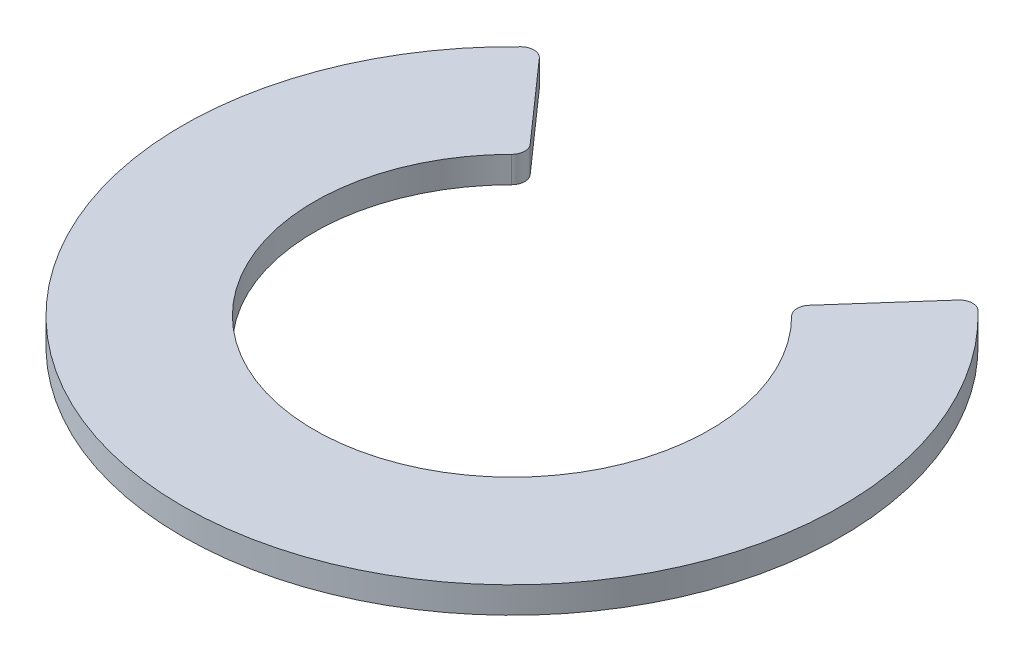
from build123d import *

# Parameters (mm, degrees)
BOSS_EXTRUDE1_DEPTH = 0.2
FILLET1_R           = 0.1


with BuildPart() as part:
    # Sketch1 → Boss-Extrude1 (new body)
    with BuildSketch(Plane(origin=(0, 0, 0), x_dir=(1, 0, 0), z_dir=(0, 1, 0))):
        with BuildLine():
            Line((-1.656498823, 1.872434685), (-0.993899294, 1.123460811))
            ThreePointArc((-0.993899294, 1.123460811), (0, -1.5), (0.993899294, 1.123460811))
            Line((0.993899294, 1.123460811), (1.656498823, 1.872434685))
            ThreePointArc((1.656498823, 1.872434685), (0, -2.5), (-1.656498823, 1.872434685))
        make_face()
    extrude(amount=BOSS_EXTRUDE1_DEPTH)

    # Fillet1
    fillet1_edges = [part.edges().sort_by_distance(p)[0] for p in [
        (-1.656498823, 0.1, -1.872434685),
        (-0.993899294, 0.1, -1.123460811),
        (0.993899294, 0.1, -1.123460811),
        (1.656498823, 0.1, -1.872434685),
    ]]
    fillet(fillet1_edges, radius=FILLET1_R)


solid = part.part
